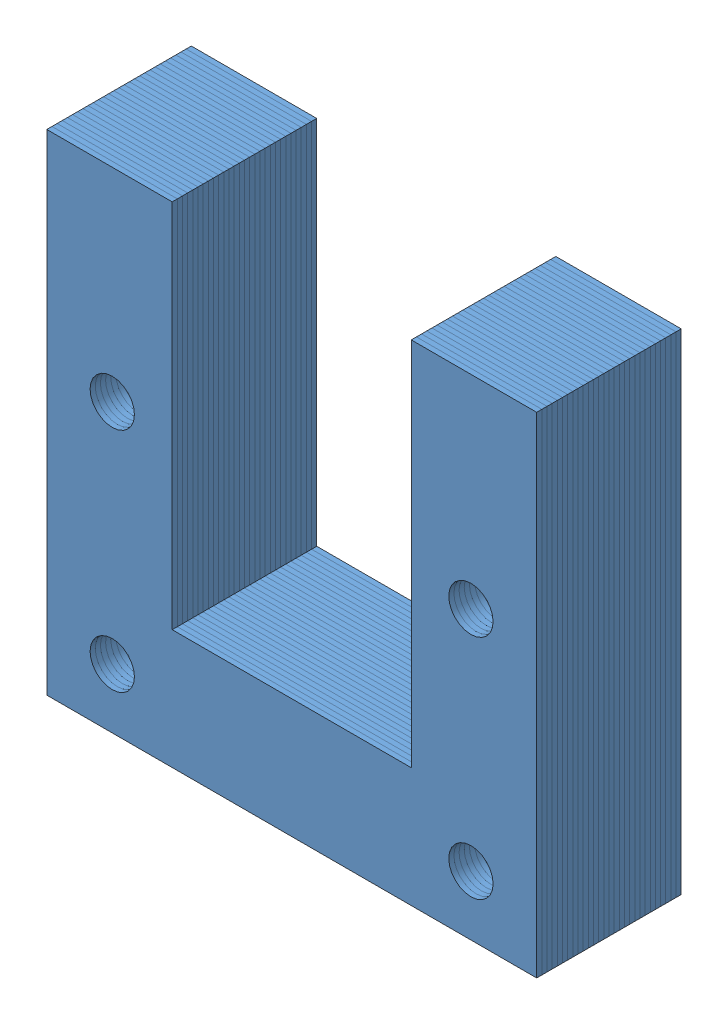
SolidWorks assembly A3003508238.SLDASM, configuration Default (file format 3100). Lengths in mm.
Overall size (32.54 32.54 9.6).
28 component instances, 1 part files, 0 mates.
Components (placement in the parent):
- A1003524911-1: A1003524911.SLDPRT [Default] at origin size (32.54 32.54 0.34)
- A1003524911-2: A1003524911.SLDPRT [Default] at (0 0 -0.3429) size (32.54 32.54 0.34)
- A1003524911-3: A1003524911.SLDPRT [Default] at (0 0 -0.6858) size (32.54 32.54 0.34)
- A1003524911-4: A1003524911.SLDPRT [Default] at (0 0 -1.0287) size (32.54 32.54 0.34)
- A1003524911-5: A1003524911.SLDPRT [Default] at (0 0 -1.3716) size (32.54 32.54 0.34)
- A1003524911-6: A1003524911.SLDPRT [Default] at (0 0 -1.7145) size (32.54 32.54 0.34)
- A1003524911-7: A1003524911.SLDPRT [Default] at (0 0 -2.0574) size (32.54 32.54 0.34)
- A1003524911-8: A1003524911.SLDPRT [Default] at (0 0 -2.4003) size (32.54 32.54 0.34)
- A1003524911-9: A1003524911.SLDPRT [Default] at (0 0 -2.7432) size (32.54 32.54 0.34)
- A1003524911-10: A1003524911.SLDPRT [Default] at (0 0 -3.0861) size (32.54 32.54 0.34)
- A1003524911-11: A1003524911.SLDPRT [Default] at (0 0 -3.429) size (32.54 32.54 0.34)
- A1003524911-12: A1003524911.SLDPRT [Default] at (0 0 -3.7719) size (32.54 32.54 0.34)
- A1003524911-13: A1003524911.SLDPRT [Default] at (0 0 -4.1148) size (32.54 32.54 0.34)
- A1003524911-14: A1003524911.SLDPRT [Default] at (0 0 -4.4577) size (32.54 32.54 0.34)
- A1003524911-15: A1003524911.SLDPRT [Default] at (0 0 -4.8006) size (32.54 32.54 0.34)
- A1003524911-16: A1003524911.SLDPRT [Default] at (0 0 -5.1435) size (32.54 32.54 0.34)
- A1003524911-17: A1003524911.SLDPRT [Default] at (0 0 -5.4864) size (32.54 32.54 0.34)
- A1003524911-18: A1003524911.SLDPRT [Default] at (0 0 -5.8293) size (32.54 32.54 0.34)
- A1003524911-19: A1003524911.SLDPRT [Default] at (0 0 -6.1722) size (32.54 32.54 0.34)
- A1003524911-20: A1003524911.SLDPRT [Default] at (0 0 -6.5151) size (32.54 32.54 0.34)
- A1003524911-21: A1003524911.SLDPRT [Default] at (0 0 -6.858) size (32.54 32.54 0.34)
- A1003524911-22: A1003524911.SLDPRT [Default] at (0 0 -7.2009) size (32.54 32.54 0.34)
- A1003524911-23: A1003524911.SLDPRT [Default] at (0 0 -7.5438) size (32.54 32.54 0.34)
- A1003524911-24: A1003524911.SLDPRT [Default] at (0 0 -7.8867) size (32.54 32.54 0.34)
- A1003524911-25: A1003524911.SLDPRT [Default] at (0 0 -8.2296) size (32.54 32.54 0.34)
- A1003524911-26: A1003524911.SLDPRT [Default] at (0 0 -8.5725) size (32.54 32.54 0.34)
- A1003524911-27: A1003524911.SLDPRT [Default] at (0 0 -8.9154) size (32.54 32.54 0.34)
- A1003524911-28: A1003524911.SLDPRT [Default] at (0 0 -9.2583) size (32.54 32.54 0.34)
